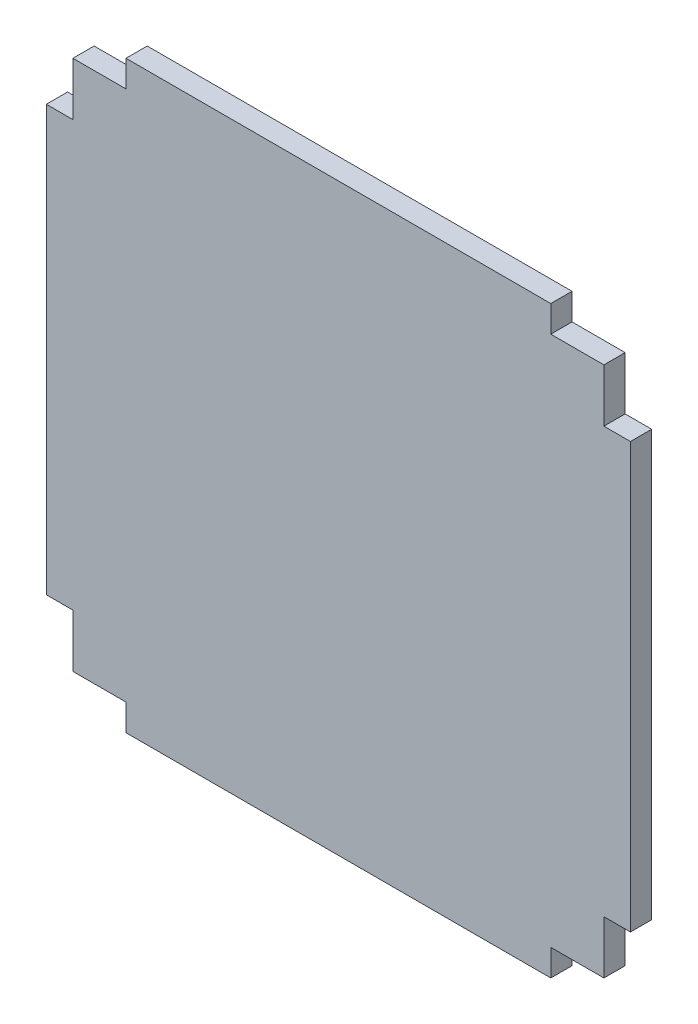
ISO-10303-21;
HEADER;
FILE_DESCRIPTION(('STEP AP214'),'2;1');
FILE_NAME('part.step','',(''),(''),'','','');
FILE_SCHEMA(('AUTOMOTIVE_DESIGN { 1 0 10303 214 1 1 1 1 }'));
ENDSEC;
DATA;
#1=APPLICATION_CONTEXT('core data for automotive mechanical design processes');
#2=APPLICATION_PROTOCOL_DEFINITION('international standard','automotive_design',2000,#1);
#3=PRODUCT_CONTEXT('',#1,'mechanical');
#4=PRODUCT('Part','Part','',(#3));
#5=PRODUCT_RELATED_PRODUCT_CATEGORY('part','',(#4));
#6=PRODUCT_DEFINITION_FORMATION('','',#4);
#7=PRODUCT_DEFINITION_CONTEXT('part definition',#1,'design');
#8=PRODUCT_DEFINITION('design','',#6,#7);
#9=PRODUCT_DEFINITION_SHAPE('','',#8);
#10=(LENGTH_UNIT() NAMED_UNIT(*) SI_UNIT(.MILLI.,.METRE.));
#11=(NAMED_UNIT(*) PLANE_ANGLE_UNIT() SI_UNIT($,.RADIAN.));
#12=(NAMED_UNIT(*) SI_UNIT($,.STERADIAN.) SOLID_ANGLE_UNIT());
#13=UNCERTAINTY_MEASURE_WITH_UNIT(LENGTH_MEASURE(1.E-05),#10,'distance_accuracy_value','');
#14=(GEOMETRIC_REPRESENTATION_CONTEXT(3) GLOBAL_UNCERTAINTY_ASSIGNED_CONTEXT((#13)) GLOBAL_UNIT_ASSIGNED_CONTEXT((#10,
#11,#12)) REPRESENTATION_CONTEXT('',''));
#15=CARTESIAN_POINT('',(0.,0.,0.));
#16=DIRECTION('',(0.,0.,1.));
#17=DIRECTION('',(1.,0.,0.));
#18=AXIS2_PLACEMENT_3D('',#15,#16,#17);
#19=CARTESIAN_POINT('',(0.,55.,4.));
#20=DIRECTION('',(0.,-1.,0.));
#21=DIRECTION('',(0.,0.,-1.));
#22=AXIS2_PLACEMENT_3D('',#19,#20,#21);
#23=PLANE('',#22);
#24=DIRECTION('',(-1.,0.,0.));
#25=VECTOR('',#24,1.);
#26=CARTESIAN_POINT('',(0.,55.,0.));
#27=LINE('',#26,#25);
#28=CARTESIAN_POINT('',(40.,55.,0.));
#29=VERTEX_POINT('',#28);
#30=CARTESIAN_POINT('',(-40.,55.,0.));
#31=VERTEX_POINT('',#30);
#32=EDGE_CURVE('E121',#29,#31,#27,.T.);
#33=ORIENTED_EDGE('',*,*,#32,.T.);
#34=DIRECTION('',(0.,0.,-1.));
#35=VECTOR('',#34,1.);
#36=CARTESIAN_POINT('',(-40.,55.,4.));
#37=LINE('',#36,#35);
#38=CARTESIAN_POINT('',(-40.,55.,4.));
#39=VERTEX_POINT('',#38);
#40=EDGE_CURVE('E11',#39,#31,#37,.T.);
#41=ORIENTED_EDGE('',*,*,#40,.F.);
#42=DIRECTION('',(-1.,0.,0.));
#43=VECTOR('',#42,1.);
#44=CARTESIAN_POINT('',(0.,55.,4.));
#45=LINE('',#44,#43);
#46=CARTESIAN_POINT('',(40.,55.,4.));
#47=VERTEX_POINT('',#46);
#48=EDGE_CURVE('E127',#47,#39,#45,.T.);
#49=ORIENTED_EDGE('',*,*,#48,.F.);
#50=DIRECTION('',(0.,0.,-1.));
#51=VECTOR('',#50,1.);
#52=CARTESIAN_POINT('',(40.,55.,4.));
#53=LINE('',#52,#51);
#54=EDGE_CURVE('E197',#47,#29,#53,.T.);
#55=ORIENTED_EDGE('',*,*,#54,.T.);
#56=EDGE_LOOP('',(#33,#41,#49,#55));
#57=FACE_BOUND('',#56,.T.);
#58=ADVANCED_FACE('F33',(#57),#23,.F.);
#59=CARTESIAN_POINT('',(-40.,55.,4.));
#60=DIRECTION('',(1.,0.,0.));
#61=DIRECTION('',(0.,0.,-1.));
#62=AXIS2_PLACEMENT_3D('',#59,#60,#61);
#63=PLANE('',#62);
#64=DIRECTION('',(0.,-1.,0.));
#65=VECTOR('',#64,1.);
#66=CARTESIAN_POINT('',(-40.,55.,0.));
#67=LINE('',#66,#65);
#68=CARTESIAN_POINT('',(-40.,50.,0.));
#69=VERTEX_POINT('',#68);
#70=EDGE_CURVE('E202',#31,#69,#67,.T.);
#71=ORIENTED_EDGE('',*,*,#70,.T.);
#72=DIRECTION('',(0.,0.,-1.));
#73=VECTOR('',#72,1.);
#74=CARTESIAN_POINT('',(-40.,50.,4.));
#75=LINE('',#74,#73);
#76=CARTESIAN_POINT('',(-40.,50.,4.));
#77=VERTEX_POINT('',#76);
#78=EDGE_CURVE('E41',#77,#69,#75,.T.);
#79=ORIENTED_EDGE('',*,*,#78,.F.);
#80=DIRECTION('',(0.,-1.,0.));
#81=VECTOR('',#80,1.);
#82=CARTESIAN_POINT('',(-40.,55.,4.));
#83=LINE('',#82,#81);
#84=EDGE_CURVE('E346',#39,#77,#83,.T.);
#85=ORIENTED_EDGE('',*,*,#84,.F.);
#86=ORIENTED_EDGE('',*,*,#40,.T.);
#87=EDGE_LOOP('',(#71,#79,#85,#86));
#88=FACE_BOUND('',#87,.T.);
#89=ADVANCED_FACE('F349',(#88),#63,.F.);
#90=CARTESIAN_POINT('',(-40.,50.,4.));
#91=DIRECTION('',(0.,-1.,0.));
#92=DIRECTION('',(0.,0.,-1.));
#93=AXIS2_PLACEMENT_3D('',#90,#91,#92);
#94=PLANE('',#93);
#95=DIRECTION('',(-1.,0.,0.));
#96=VECTOR('',#95,1.);
#97=CARTESIAN_POINT('',(-40.,50.,0.));
#98=LINE('',#97,#96);
#99=CARTESIAN_POINT('',(-50.,50.,0.));
#100=VERTEX_POINT('',#99);
#101=EDGE_CURVE('E204',#69,#100,#98,.T.);
#102=ORIENTED_EDGE('',*,*,#101,.T.);
#103=DIRECTION('',(0.,0.,-1.));
#104=VECTOR('',#103,1.);
#105=CARTESIAN_POINT('',(-50.,50.,4.));
#106=LINE('',#105,#104);
#107=CARTESIAN_POINT('',(-50.,50.,4.));
#108=VERTEX_POINT('',#107);
#109=EDGE_CURVE('E281',#108,#100,#106,.T.);
#110=ORIENTED_EDGE('',*,*,#109,.F.);
#111=DIRECTION('',(-1.,0.,0.));
#112=VECTOR('',#111,1.);
#113=CARTESIAN_POINT('',(-40.,50.,4.));
#114=LINE('',#113,#112);
#115=EDGE_CURVE('E290',#77,#108,#114,.T.);
#116=ORIENTED_EDGE('',*,*,#115,.F.);
#117=ORIENTED_EDGE('',*,*,#78,.T.);
#118=EDGE_LOOP('',(#102,#110,#116,#117));
#119=FACE_BOUND('',#118,.T.);
#120=ADVANCED_FACE('F288',(#119),#94,.F.);
#121=CARTESIAN_POINT('',(-50.,50.,4.));
#122=DIRECTION('',(1.,0.,0.));
#123=DIRECTION('',(0.,0.,-1.));
#124=AXIS2_PLACEMENT_3D('',#121,#122,#123);
#125=PLANE('',#124);
#126=DIRECTION('',(0.,-1.,0.));
#127=VECTOR('',#126,1.);
#128=CARTESIAN_POINT('',(-50.,50.,0.));
#129=LINE('',#128,#127);
#130=CARTESIAN_POINT('',(-50.,40.,0.));
#131=VERTEX_POINT('',#130);
#132=EDGE_CURVE('E206',#100,#131,#129,.T.);
#133=ORIENTED_EDGE('',*,*,#132,.T.);
#134=DIRECTION('',(0.,0.,-1.));
#135=VECTOR('',#134,1.);
#136=CARTESIAN_POINT('',(-50.,40.,4.));
#137=LINE('',#136,#135);
#138=CARTESIAN_POINT('',(-50.,40.,4.));
#139=VERTEX_POINT('',#138);
#140=EDGE_CURVE('E278',#139,#131,#137,.T.);
#141=ORIENTED_EDGE('',*,*,#140,.F.);
#142=DIRECTION('',(0.,-1.,0.));
#143=VECTOR('',#142,1.);
#144=CARTESIAN_POINT('',(-50.,50.,4.));
#145=LINE('',#144,#143);
#146=EDGE_CURVE('E308',#108,#139,#145,.T.);
#147=ORIENTED_EDGE('',*,*,#146,.F.);
#148=ORIENTED_EDGE('',*,*,#109,.T.);
#149=EDGE_LOOP('',(#133,#141,#147,#148));
#150=FACE_BOUND('',#149,.T.);
#151=ADVANCED_FACE('F299',(#150),#125,.F.);
#152=CARTESIAN_POINT('',(-50.,40.,4.));
#153=DIRECTION('',(0.,-1.,0.));
#154=DIRECTION('',(0.,0.,-1.));
#155=AXIS2_PLACEMENT_3D('',#152,#153,#154);
#156=PLANE('',#155);
#157=DIRECTION('',(-1.,0.,0.));
#158=VECTOR('',#157,1.);
#159=CARTESIAN_POINT('',(-50.,40.,0.));
#160=LINE('',#159,#158);
#161=CARTESIAN_POINT('',(-55.,40.,0.));
#162=VERTEX_POINT('',#161);
#163=EDGE_CURVE('E208',#131,#162,#160,.T.);
#164=ORIENTED_EDGE('',*,*,#163,.T.);
#165=DIRECTION('',(0.,0.,-1.));
#166=VECTOR('',#165,1.);
#167=CARTESIAN_POINT('',(-55.,40.,4.));
#168=LINE('',#167,#166);
#169=CARTESIAN_POINT('',(-55.,40.,4.));
#170=VERTEX_POINT('',#169);
#171=EDGE_CURVE('E275',#170,#162,#168,.T.);
#172=ORIENTED_EDGE('',*,*,#171,.F.);
#173=DIRECTION('',(-1.,0.,0.));
#174=VECTOR('',#173,1.);
#175=CARTESIAN_POINT('',(-50.,40.,4.));
#176=LINE('',#175,#174);
#177=EDGE_CURVE('E305',#139,#170,#176,.T.);
#178=ORIENTED_EDGE('',*,*,#177,.F.);
#179=ORIENTED_EDGE('',*,*,#140,.T.);
#180=EDGE_LOOP('',(#164,#172,#178,#179));
#181=FACE_BOUND('',#180,.T.);
#182=ADVANCED_FACE('F303',(#181),#156,.F.);
#183=CARTESIAN_POINT('',(-55.,40.,4.));
#184=DIRECTION('',(1.,0.,0.));
#185=DIRECTION('',(0.,0.,-1.));
#186=AXIS2_PLACEMENT_3D('',#183,#184,#185);
#187=PLANE('',#186);
#188=DIRECTION('',(0.,-1.,0.));
#189=VECTOR('',#188,1.);
#190=CARTESIAN_POINT('',(-55.,40.,0.));
#191=LINE('',#190,#189);
#192=CARTESIAN_POINT('',(-55.,-40.,0.));
#193=VERTEX_POINT('',#192);
#194=EDGE_CURVE('E210',#162,#193,#191,.T.);
#195=ORIENTED_EDGE('',*,*,#194,.T.);
#196=DIRECTION('',(0.,0.,-1.));
#197=VECTOR('',#196,1.);
#198=CARTESIAN_POINT('',(-55.,-40.,4.));
#199=LINE('',#198,#197);
#200=CARTESIAN_POINT('',(-55.,-40.,4.));
#201=VERTEX_POINT('',#200);
#202=EDGE_CURVE('E272',#201,#193,#199,.T.);
#203=ORIENTED_EDGE('',*,*,#202,.F.);
#204=DIRECTION('',(0.,-1.,0.));
#205=VECTOR('',#204,1.);
#206=CARTESIAN_POINT('',(-55.,40.,4.));
#207=LINE('',#206,#205);
#208=EDGE_CURVE('E307',#170,#201,#207,.T.);
#209=ORIENTED_EDGE('',*,*,#208,.F.);
#210=ORIENTED_EDGE('',*,*,#171,.T.);
#211=EDGE_LOOP('',(#195,#203,#209,#210));
#212=FACE_BOUND('',#211,.T.);
#213=ADVANCED_FACE('F361',(#212),#187,.F.);
#214=CARTESIAN_POINT('',(-55.,-40.,4.));
#215=DIRECTION('',(0.,1.,0.));
#216=DIRECTION('',(0.,0.,1.));
#217=AXIS2_PLACEMENT_3D('',#214,#215,#216);
#218=PLANE('',#217);
#219=DIRECTION('',(1.,0.,0.));
#220=VECTOR('',#219,1.);
#221=CARTESIAN_POINT('',(-55.,-40.,0.));
#222=LINE('',#221,#220);
#223=CARTESIAN_POINT('',(-50.,-40.,0.));
#224=VERTEX_POINT('',#223);
#225=EDGE_CURVE('E212',#193,#224,#222,.T.);
#226=ORIENTED_EDGE('',*,*,#225,.T.);
#227=DIRECTION('',(0.,0.,-1.));
#228=VECTOR('',#227,1.);
#229=CARTESIAN_POINT('',(-50.,-40.,4.));
#230=LINE('',#229,#228);
#231=CARTESIAN_POINT('',(-50.,-40.,4.));
#232=VERTEX_POINT('',#231);
#233=EDGE_CURVE('E269',#232,#224,#230,.T.);
#234=ORIENTED_EDGE('',*,*,#233,.F.);
#235=DIRECTION('',(1.,0.,0.));
#236=VECTOR('',#235,1.);
#237=CARTESIAN_POINT('',(-55.,-40.,4.));
#238=LINE('',#237,#236);
#239=EDGE_CURVE('E310',#201,#232,#238,.T.);
#240=ORIENTED_EDGE('',*,*,#239,.F.);
#241=ORIENTED_EDGE('',*,*,#202,.T.);
#242=EDGE_LOOP('',(#226,#234,#240,#241));
#243=FACE_BOUND('',#242,.T.);
#244=ADVANCED_FACE('F364',(#243),#218,.F.);
#245=CARTESIAN_POINT('',(-50.,-40.,4.));
#246=DIRECTION('',(1.,0.,0.));
#247=DIRECTION('',(0.,0.,-1.));
#248=AXIS2_PLACEMENT_3D('',#245,#246,#247);
#249=PLANE('',#248);
#250=DIRECTION('',(0.,-1.,0.));
#251=VECTOR('',#250,1.);
#252=CARTESIAN_POINT('',(-50.,-40.,0.));
#253=LINE('',#252,#251);
#254=CARTESIAN_POINT('',(-50.,-50.,0.));
#255=VERTEX_POINT('',#254);
#256=EDGE_CURVE('E214',#224,#255,#253,.T.);
#257=ORIENTED_EDGE('',*,*,#256,.T.);
#258=DIRECTION('',(0.,0.,-1.));
#259=VECTOR('',#258,1.);
#260=CARTESIAN_POINT('',(-50.,-50.,4.));
#261=LINE('',#260,#259);
#262=CARTESIAN_POINT('',(-50.,-50.,4.));
#263=VERTEX_POINT('',#262);
#264=EDGE_CURVE('E266',#263,#255,#261,.T.);
#265=ORIENTED_EDGE('',*,*,#264,.F.);
#266=DIRECTION('',(0.,-1.,0.));
#267=VECTOR('',#266,1.);
#268=CARTESIAN_POINT('',(-50.,-40.,4.));
#269=LINE('',#268,#267);
#270=EDGE_CURVE('E316',#232,#263,#269,.T.);
#271=ORIENTED_EDGE('',*,*,#270,.F.);
#272=ORIENTED_EDGE('',*,*,#233,.T.);
#273=EDGE_LOOP('',(#257,#265,#271,#272));
#274=FACE_BOUND('',#273,.T.);
#275=ADVANCED_FACE('F368',(#274),#249,.F.);
#276=CARTESIAN_POINT('',(-50.,-50.,4.));
#277=DIRECTION('',(0.,1.,0.));
#278=DIRECTION('',(0.,0.,1.));
#279=AXIS2_PLACEMENT_3D('',#276,#277,#278);
#280=PLANE('',#279);
#281=DIRECTION('',(1.,0.,0.));
#282=VECTOR('',#281,1.);
#283=CARTESIAN_POINT('',(-50.,-50.,0.));
#284=LINE('',#283,#282);
#285=CARTESIAN_POINT('',(-40.,-50.,0.));
#286=VERTEX_POINT('',#285);
#287=EDGE_CURVE('E216',#255,#286,#284,.T.);
#288=ORIENTED_EDGE('',*,*,#287,.T.);
#289=DIRECTION('',(0.,0.,-1.));
#290=VECTOR('',#289,1.);
#291=CARTESIAN_POINT('',(-40.,-50.,4.));
#292=LINE('',#291,#290);
#293=CARTESIAN_POINT('',(-40.,-50.,4.));
#294=VERTEX_POINT('',#293);
#295=EDGE_CURVE('E263',#294,#286,#292,.T.);
#296=ORIENTED_EDGE('',*,*,#295,.F.);
#297=DIRECTION('',(1.,0.,0.));
#298=VECTOR('',#297,1.);
#299=CARTESIAN_POINT('',(-50.,-50.,4.));
#300=LINE('',#299,#298);
#301=EDGE_CURVE('E318',#263,#294,#300,.T.);
#302=ORIENTED_EDGE('',*,*,#301,.F.);
#303=ORIENTED_EDGE('',*,*,#264,.T.);
#304=EDGE_LOOP('',(#288,#296,#302,#303));
#305=FACE_BOUND('',#304,.T.);
#306=ADVANCED_FACE('F372',(#305),#280,.F.);
#307=CARTESIAN_POINT('',(-40.,-50.,4.));
#308=DIRECTION('',(1.,0.,0.));
#309=DIRECTION('',(0.,0.,-1.));
#310=AXIS2_PLACEMENT_3D('',#307,#308,#309);
#311=PLANE('',#310);
#312=DIRECTION('',(0.,-1.,0.));
#313=VECTOR('',#312,1.);
#314=CARTESIAN_POINT('',(-40.,-50.,0.));
#315=LINE('',#314,#313);
#316=CARTESIAN_POINT('',(-40.,-55.,0.));
#317=VERTEX_POINT('',#316);
#318=EDGE_CURVE('E218',#286,#317,#315,.T.);
#319=ORIENTED_EDGE('',*,*,#318,.T.);
#320=DIRECTION('',(0.,0.,-1.));
#321=VECTOR('',#320,1.);
#322=CARTESIAN_POINT('',(-40.,-55.,4.));
#323=LINE('',#322,#321);
#324=CARTESIAN_POINT('',(-40.,-55.,4.));
#325=VERTEX_POINT('',#324);
#326=EDGE_CURVE('E260',#325,#317,#323,.T.);
#327=ORIENTED_EDGE('',*,*,#326,.F.);
#328=DIRECTION('',(0.,-1.,0.));
#329=VECTOR('',#328,1.);
#330=CARTESIAN_POINT('',(-40.,-50.,4.));
#331=LINE('',#330,#329);
#332=EDGE_CURVE('E320',#294,#325,#331,.T.);
#333=ORIENTED_EDGE('',*,*,#332,.F.);
#334=ORIENTED_EDGE('',*,*,#295,.T.);
#335=EDGE_LOOP('',(#319,#327,#333,#334));
#336=FACE_BOUND('',#335,.T.);
#337=ADVANCED_FACE('F376',(#336),#311,.F.);
#338=CARTESIAN_POINT('',(-40.,-55.,4.));
#339=DIRECTION('',(0.,1.,0.));
#340=DIRECTION('',(0.,0.,1.));
#341=AXIS2_PLACEMENT_3D('',#338,#339,#340);
#342=PLANE('',#341);
#343=DIRECTION('',(1.,0.,0.));
#344=VECTOR('',#343,1.);
#345=CARTESIAN_POINT('',(-40.,-55.,0.));
#346=LINE('',#345,#344);
#347=CARTESIAN_POINT('',(40.,-55.,0.));
#348=VERTEX_POINT('',#347);
#349=EDGE_CURVE('E220',#317,#348,#346,.T.);
#350=ORIENTED_EDGE('',*,*,#349,.T.);
#351=DIRECTION('',(0.,0.,-1.));
#352=VECTOR('',#351,1.);
#353=CARTESIAN_POINT('',(40.,-55.,4.));
#354=LINE('',#353,#352);
#355=CARTESIAN_POINT('',(40.,-55.,4.));
#356=VERTEX_POINT('',#355);
#357=EDGE_CURVE('E257',#356,#348,#354,.T.);
#358=ORIENTED_EDGE('',*,*,#357,.F.);
#359=DIRECTION('',(1.,0.,0.));
#360=VECTOR('',#359,1.);
#361=CARTESIAN_POINT('',(-40.,-55.,4.));
#362=LINE('',#361,#360);
#363=EDGE_CURVE('E322',#325,#356,#362,.T.);
#364=ORIENTED_EDGE('',*,*,#363,.F.);
#365=ORIENTED_EDGE('',*,*,#326,.T.);
#366=EDGE_LOOP('',(#350,#358,#364,#365));
#367=FACE_BOUND('',#366,.T.);
#368=ADVANCED_FACE('F380',(#367),#342,.F.);
#369=CARTESIAN_POINT('',(40.,-50.,4.));
#370=DIRECTION('',(-1.,0.,0.));
#371=DIRECTION('',(0.,0.,1.));
#372=AXIS2_PLACEMENT_3D('',#369,#370,#371);
#373=PLANE('',#372);
#374=DIRECTION('',(0.,1.,0.));
#375=VECTOR('',#374,1.);
#376=CARTESIAN_POINT('',(40.,-50.,0.));
#377=LINE('',#376,#375);
#378=CARTESIAN_POINT('',(40.,-50.,0.));
#379=VERTEX_POINT('',#378);
#380=EDGE_CURVE('E222',#348,#379,#377,.T.);
#381=ORIENTED_EDGE('',*,*,#380,.T.);
#382=DIRECTION('',(0.,0.,-1.));
#383=VECTOR('',#382,1.);
#384=CARTESIAN_POINT('',(40.,-50.,4.));
#385=LINE('',#384,#383);
#386=CARTESIAN_POINT('',(40.,-50.,4.));
#387=VERTEX_POINT('',#386);
#388=EDGE_CURVE('E254',#387,#379,#385,.T.);
#389=ORIENTED_EDGE('',*,*,#388,.F.);
#390=DIRECTION('',(0.,1.,0.));
#391=VECTOR('',#390,1.);
#392=CARTESIAN_POINT('',(40.,-50.,4.));
#393=LINE('',#392,#391);
#394=EDGE_CURVE('E324',#356,#387,#393,.T.);
#395=ORIENTED_EDGE('',*,*,#394,.F.);
#396=ORIENTED_EDGE('',*,*,#357,.T.);
#397=EDGE_LOOP('',(#381,#389,#395,#396));
#398=FACE_BOUND('',#397,.T.);
#399=ADVANCED_FACE('F384',(#398),#373,.F.);
#400=CARTESIAN_POINT('',(50.,-50.,4.));
#401=DIRECTION('',(0.,1.,0.));
#402=DIRECTION('',(0.,0.,1.));
#403=AXIS2_PLACEMENT_3D('',#400,#401,#402);
#404=PLANE('',#403);
#405=DIRECTION('',(1.,0.,0.));
#406=VECTOR('',#405,1.);
#407=CARTESIAN_POINT('',(50.,-50.,0.));
#408=LINE('',#407,#406);
#409=CARTESIAN_POINT('',(50.,-50.,0.));
#410=VERTEX_POINT('',#409);
#411=EDGE_CURVE('E224',#379,#410,#408,.T.);
#412=ORIENTED_EDGE('',*,*,#411,.T.);
#413=DIRECTION('',(0.,0.,-1.));
#414=VECTOR('',#413,1.);
#415=CARTESIAN_POINT('',(50.,-50.,4.));
#416=LINE('',#415,#414);
#417=CARTESIAN_POINT('',(50.,-50.,4.));
#418=VERTEX_POINT('',#417);
#419=EDGE_CURVE('E251',#418,#410,#416,.T.);
#420=ORIENTED_EDGE('',*,*,#419,.F.);
#421=DIRECTION('',(1.,0.,0.));
#422=VECTOR('',#421,1.);
#423=CARTESIAN_POINT('',(50.,-50.,4.));
#424=LINE('',#423,#422);
#425=EDGE_CURVE('E326',#387,#418,#424,.T.);
#426=ORIENTED_EDGE('',*,*,#425,.F.);
#427=ORIENTED_EDGE('',*,*,#388,.T.);
#428=EDGE_LOOP('',(#412,#420,#426,#427));
#429=FACE_BOUND('',#428,.T.);
#430=ADVANCED_FACE('F388',(#429),#404,.F.);
#431=CARTESIAN_POINT('',(50.,-40.,4.));
#432=DIRECTION('',(-1.,0.,0.));
#433=DIRECTION('',(0.,0.,1.));
#434=AXIS2_PLACEMENT_3D('',#431,#432,#433);
#435=PLANE('',#434);
#436=DIRECTION('',(0.,1.,0.));
#437=VECTOR('',#436,1.);
#438=CARTESIAN_POINT('',(50.,-40.,0.));
#439=LINE('',#438,#437);
#440=CARTESIAN_POINT('',(50.,-40.,0.));
#441=VERTEX_POINT('',#440);
#442=EDGE_CURVE('E226',#410,#441,#439,.T.);
#443=ORIENTED_EDGE('',*,*,#442,.T.);
#444=DIRECTION('',(0.,0.,-1.));
#445=VECTOR('',#444,1.);
#446=CARTESIAN_POINT('',(50.,-40.,4.));
#447=LINE('',#446,#445);
#448=CARTESIAN_POINT('',(50.,-40.,4.));
#449=VERTEX_POINT('',#448);
#450=EDGE_CURVE('E248',#449,#441,#447,.T.);
#451=ORIENTED_EDGE('',*,*,#450,.F.);
#452=DIRECTION('',(0.,1.,0.));
#453=VECTOR('',#452,1.);
#454=CARTESIAN_POINT('',(50.,-40.,4.));
#455=LINE('',#454,#453);
#456=EDGE_CURVE('E328',#418,#449,#455,.T.);
#457=ORIENTED_EDGE('',*,*,#456,.F.);
#458=ORIENTED_EDGE('',*,*,#419,.T.);
#459=EDGE_LOOP('',(#443,#451,#457,#458));
#460=FACE_BOUND('',#459,.T.);
#461=ADVANCED_FACE('F392',(#460),#435,.F.);
#462=CARTESIAN_POINT('',(55.,-40.,4.));
#463=DIRECTION('',(0.,1.,0.));
#464=DIRECTION('',(0.,0.,1.));
#465=AXIS2_PLACEMENT_3D('',#462,#463,#464);
#466=PLANE('',#465);
#467=DIRECTION('',(1.,0.,0.));
#468=VECTOR('',#467,1.);
#469=CARTESIAN_POINT('',(55.,-40.,0.));
#470=LINE('',#469,#468);
#471=CARTESIAN_POINT('',(55.,-40.,0.));
#472=VERTEX_POINT('',#471);
#473=EDGE_CURVE('E228',#441,#472,#470,.T.);
#474=ORIENTED_EDGE('',*,*,#473,.T.);
#475=DIRECTION('',(0.,0.,-1.));
#476=VECTOR('',#475,1.);
#477=CARTESIAN_POINT('',(55.,-40.,4.));
#478=LINE('',#477,#476);
#479=CARTESIAN_POINT('',(55.,-40.,4.));
#480=VERTEX_POINT('',#479);
#481=EDGE_CURVE('E245',#480,#472,#478,.T.);
#482=ORIENTED_EDGE('',*,*,#481,.F.);
#483=DIRECTION('',(1.,0.,0.));
#484=VECTOR('',#483,1.);
#485=CARTESIAN_POINT('',(55.,-40.,4.));
#486=LINE('',#485,#484);
#487=EDGE_CURVE('E330',#449,#480,#486,.T.);
#488=ORIENTED_EDGE('',*,*,#487,.F.);
#489=ORIENTED_EDGE('',*,*,#450,.T.);
#490=EDGE_LOOP('',(#474,#482,#488,#489));
#491=FACE_BOUND('',#490,.T.);
#492=ADVANCED_FACE('F396',(#491),#466,.F.);
#493=CARTESIAN_POINT('',(55.,40.,4.));
#494=DIRECTION('',(-1.,0.,0.));
#495=DIRECTION('',(0.,0.,1.));
#496=AXIS2_PLACEMENT_3D('',#493,#494,#495);
#497=PLANE('',#496);
#498=DIRECTION('',(0.,1.,0.));
#499=VECTOR('',#498,1.);
#500=CARTESIAN_POINT('',(55.,40.,0.));
#501=LINE('',#500,#499);
#502=CARTESIAN_POINT('',(55.,40.,0.));
#503=VERTEX_POINT('',#502);
#504=EDGE_CURVE('E230',#472,#503,#501,.T.);
#505=ORIENTED_EDGE('',*,*,#504,.T.);
#506=DIRECTION('',(0.,0.,-1.));
#507=VECTOR('',#506,1.);
#508=CARTESIAN_POINT('',(55.,40.,4.));
#509=LINE('',#508,#507);
#510=CARTESIAN_POINT('',(55.,40.,4.));
#511=VERTEX_POINT('',#510);
#512=EDGE_CURVE('E242',#511,#503,#509,.T.);
#513=ORIENTED_EDGE('',*,*,#512,.F.);
#514=DIRECTION('',(0.,1.,0.));
#515=VECTOR('',#514,1.);
#516=CARTESIAN_POINT('',(55.,40.,4.));
#517=LINE('',#516,#515);
#518=EDGE_CURVE('E332',#480,#511,#517,.T.);
#519=ORIENTED_EDGE('',*,*,#518,.F.);
#520=ORIENTED_EDGE('',*,*,#481,.T.);
#521=EDGE_LOOP('',(#505,#513,#519,#520));
#522=FACE_BOUND('',#521,.T.);
#523=ADVANCED_FACE('F338',(#522),#497,.F.);
#524=CARTESIAN_POINT('',(50.,40.,4.));
#525=DIRECTION('',(0.,-1.,0.));
#526=DIRECTION('',(0.,0.,-1.));
#527=AXIS2_PLACEMENT_3D('',#524,#525,#526);
#528=PLANE('',#527);
#529=DIRECTION('',(-1.,0.,0.));
#530=VECTOR('',#529,1.);
#531=CARTESIAN_POINT('',(50.,40.,0.));
#532=LINE('',#531,#530);
#533=CARTESIAN_POINT('',(50.,40.,0.));
#534=VERTEX_POINT('',#533);
#535=EDGE_CURVE('E232',#503,#534,#532,.T.);
#536=ORIENTED_EDGE('',*,*,#535,.T.);
#537=DIRECTION('',(0.,0.,-1.));
#538=VECTOR('',#537,1.);
#539=CARTESIAN_POINT('',(50.,40.,4.));
#540=LINE('',#539,#538);
#541=CARTESIAN_POINT('',(50.,40.,4.));
#542=VERTEX_POINT('',#541);
#543=EDGE_CURVE('E192',#542,#534,#540,.T.);
#544=ORIENTED_EDGE('',*,*,#543,.F.);
#545=DIRECTION('',(-1.,0.,0.));
#546=VECTOR('',#545,1.);
#547=CARTESIAN_POINT('',(50.,40.,4.));
#548=LINE('',#547,#546);
#549=EDGE_CURVE('E183',#511,#542,#548,.T.);
#550=ORIENTED_EDGE('',*,*,#549,.F.);
#551=ORIENTED_EDGE('',*,*,#512,.T.);
#552=EDGE_LOOP('',(#536,#544,#550,#551));
#553=FACE_BOUND('',#552,.T.);
#554=ADVANCED_FACE('F342',(#553),#528,.F.);
#555=CARTESIAN_POINT('',(50.,50.,4.));
#556=DIRECTION('',(-1.,0.,0.));
#557=DIRECTION('',(0.,0.,1.));
#558=AXIS2_PLACEMENT_3D('',#555,#556,#557);
#559=PLANE('',#558);
#560=DIRECTION('',(0.,1.,0.));
#561=VECTOR('',#560,1.);
#562=CARTESIAN_POINT('',(50.,50.,0.));
#563=LINE('',#562,#561);
#564=CARTESIAN_POINT('',(50.,50.,0.));
#565=VERTEX_POINT('',#564);
#566=EDGE_CURVE('E191',#534,#565,#563,.T.);
#567=ORIENTED_EDGE('',*,*,#566,.T.);
#568=DIRECTION('',(0.,0.,-1.));
#569=VECTOR('',#568,1.);
#570=CARTESIAN_POINT('',(50.,50.,4.));
#571=LINE('',#570,#569);
#572=CARTESIAN_POINT('',(50.,50.,4.));
#573=VERTEX_POINT('',#572);
#574=EDGE_CURVE('E188',#573,#565,#571,.T.);
#575=ORIENTED_EDGE('',*,*,#574,.F.);
#576=DIRECTION('',(0.,1.,0.));
#577=VECTOR('',#576,1.);
#578=CARTESIAN_POINT('',(50.,50.,4.));
#579=LINE('',#578,#577);
#580=EDGE_CURVE('E177',#542,#573,#579,.T.);
#581=ORIENTED_EDGE('',*,*,#580,.F.);
#582=ORIENTED_EDGE('',*,*,#543,.T.);
#583=EDGE_LOOP('',(#567,#575,#581,#582));
#584=FACE_BOUND('',#583,.T.);
#585=ADVANCED_FACE('F189',(#584),#559,.F.);
#586=CARTESIAN_POINT('',(40.,50.,4.));
#587=DIRECTION('',(0.,-1.,0.));
#588=DIRECTION('',(0.,0.,-1.));
#589=AXIS2_PLACEMENT_3D('',#586,#587,#588);
#590=PLANE('',#589);
#591=DIRECTION('',(-1.,0.,0.));
#592=VECTOR('',#591,1.);
#593=CARTESIAN_POINT('',(40.,50.,0.));
#594=LINE('',#593,#592);
#595=CARTESIAN_POINT('',(40.,50.,0.));
#596=VERTEX_POINT('',#595);
#597=EDGE_CURVE('E114',#565,#596,#594,.T.);
#598=ORIENTED_EDGE('',*,*,#597,.T.);
#599=DIRECTION('',(0.,0.,-1.));
#600=VECTOR('',#599,1.);
#601=CARTESIAN_POINT('',(40.,50.,4.));
#602=LINE('',#601,#600);
#603=CARTESIAN_POINT('',(40.,50.,4.));
#604=VERTEX_POINT('',#603);
#605=EDGE_CURVE('E193',#604,#596,#602,.T.);
#606=ORIENTED_EDGE('',*,*,#605,.F.);
#607=DIRECTION('',(-1.,0.,0.));
#608=VECTOR('',#607,1.);
#609=CARTESIAN_POINT('',(40.,50.,4.));
#610=LINE('',#609,#608);
#611=EDGE_CURVE('E181',#573,#604,#610,.T.);
#612=ORIENTED_EDGE('',*,*,#611,.F.);
#613=ORIENTED_EDGE('',*,*,#574,.T.);
#614=EDGE_LOOP('',(#598,#606,#612,#613));
#615=FACE_BOUND('',#614,.T.);
#616=ADVANCED_FACE('F195',(#615),#590,.F.);
#617=CARTESIAN_POINT('',(40.,55.,4.));
#618=DIRECTION('',(-1.,0.,0.));
#619=DIRECTION('',(0.,0.,1.));
#620=AXIS2_PLACEMENT_3D('',#617,#618,#619);
#621=PLANE('',#620);
#622=DIRECTION('',(0.,1.,0.));
#623=VECTOR('',#622,1.);
#624=CARTESIAN_POINT('',(40.,55.,0.));
#625=LINE('',#624,#623);
#626=EDGE_CURVE('E236',#596,#29,#625,.T.);
#627=ORIENTED_EDGE('',*,*,#626,.T.);
#628=ORIENTED_EDGE('',*,*,#54,.F.);
#629=DIRECTION('',(0.,1.,0.));
#630=VECTOR('',#629,1.);
#631=CARTESIAN_POINT('',(40.,55.,4.));
#632=LINE('',#631,#630);
#633=EDGE_CURVE('E49',#604,#47,#632,.T.);
#634=ORIENTED_EDGE('',*,*,#633,.F.);
#635=ORIENTED_EDGE('',*,*,#605,.T.);
#636=EDGE_LOOP('',(#627,#628,#634,#635));
#637=FACE_BOUND('',#636,.T.);
#638=ADVANCED_FACE('F344',(#637),#621,.F.);
#639=CARTESIAN_POINT('',(0.,0.,4.));
#640=DIRECTION('',(0.,0.,-1.));
#641=DIRECTION('',(-1.,0.,0.));
#642=AXIS2_PLACEMENT_3D('',#639,#640,#641);
#643=PLANE('',#642);
#644=ORIENTED_EDGE('',*,*,#48,.T.);
#645=ORIENTED_EDGE('',*,*,#84,.T.);
#646=ORIENTED_EDGE('',*,*,#115,.T.);
#647=ORIENTED_EDGE('',*,*,#146,.T.);
#648=ORIENTED_EDGE('',*,*,#177,.T.);
#649=ORIENTED_EDGE('',*,*,#208,.T.);
#650=ORIENTED_EDGE('',*,*,#239,.T.);
#651=ORIENTED_EDGE('',*,*,#270,.T.);
#652=ORIENTED_EDGE('',*,*,#301,.T.);
#653=ORIENTED_EDGE('',*,*,#332,.T.);
#654=ORIENTED_EDGE('',*,*,#363,.T.);
#655=ORIENTED_EDGE('',*,*,#394,.T.);
#656=ORIENTED_EDGE('',*,*,#425,.T.);
#657=ORIENTED_EDGE('',*,*,#456,.T.);
#658=ORIENTED_EDGE('',*,*,#487,.T.);
#659=ORIENTED_EDGE('',*,*,#518,.T.);
#660=ORIENTED_EDGE('',*,*,#549,.T.);
#661=ORIENTED_EDGE('',*,*,#580,.T.);
#662=ORIENTED_EDGE('',*,*,#611,.T.);
#663=ORIENTED_EDGE('',*,*,#633,.T.);
#664=EDGE_LOOP('',(#644,#645,#646,#647,#648,#649,#650,#651,#652,#653,#654,#655,#656,#657,#658,
#659,#660,#661,#662,#663));
#665=FACE_BOUND('',#664,.T.);
#666=ADVANCED_FACE('F179',(#665),#643,.F.);
#667=CARTESIAN_POINT('',(0.,0.,0.));
#668=DIRECTION('',(0.,0.,-1.));
#669=DIRECTION('',(-1.,0.,0.));
#670=AXIS2_PLACEMENT_3D('',#667,#668,#669);
#671=PLANE('',#670);
#672=ORIENTED_EDGE('',*,*,#32,.F.);
#673=ORIENTED_EDGE('',*,*,#626,.F.);
#674=ORIENTED_EDGE('',*,*,#597,.F.);
#675=ORIENTED_EDGE('',*,*,#566,.F.);
#676=ORIENTED_EDGE('',*,*,#535,.F.);
#677=ORIENTED_EDGE('',*,*,#504,.F.);
#678=ORIENTED_EDGE('',*,*,#473,.F.);
#679=ORIENTED_EDGE('',*,*,#442,.F.);
#680=ORIENTED_EDGE('',*,*,#411,.F.);
#681=ORIENTED_EDGE('',*,*,#380,.F.);
#682=ORIENTED_EDGE('',*,*,#349,.F.);
#683=ORIENTED_EDGE('',*,*,#318,.F.);
#684=ORIENTED_EDGE('',*,*,#287,.F.);
#685=ORIENTED_EDGE('',*,*,#256,.F.);
#686=ORIENTED_EDGE('',*,*,#225,.F.);
#687=ORIENTED_EDGE('',*,*,#194,.F.);
#688=ORIENTED_EDGE('',*,*,#163,.F.);
#689=ORIENTED_EDGE('',*,*,#132,.F.);
#690=ORIENTED_EDGE('',*,*,#101,.F.);
#691=ORIENTED_EDGE('',*,*,#70,.F.);
#692=EDGE_LOOP('',(#672,#673,#674,#675,#676,#677,#678,#679,#680,#681,#682,#683,#684,#685,#686,
#687,#688,#689,#690,#691));
#693=FACE_BOUND('',#692,.T.);
#694=ADVANCED_FACE('F294',(#693),#671,.T.);
#695=CLOSED_SHELL('',(#58,#89,#120,#151,#182,#213,#244,#275,#306,#337,#368,#399,#430,#461,#492,
#523,#554,#585,#616,#638,#666,#694));
#696=MANIFOLD_SOLID_BREP('B2',#695);
#697=ADVANCED_BREP_SHAPE_REPRESENTATION('',(#18,#696),#14);
#698=SHAPE_DEFINITION_REPRESENTATION(#9,#697);
ENDSEC;
END-ISO-10303-21;
